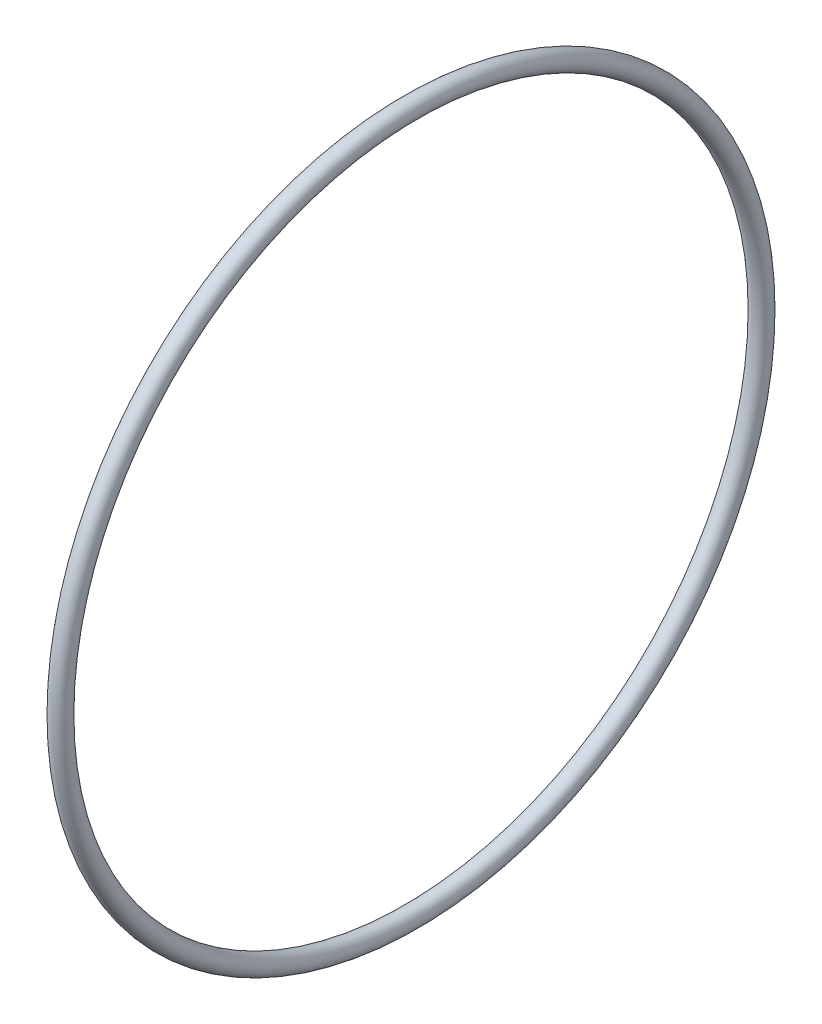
from build123d import *

# Parameters (mm, degrees)
SKETCH1_R = 1.7653


with BuildPart() as part:
    # Sketch1 → Base-Revolve (revolve)
    with BuildSketch(Plane.XY, mode=Mode.PRIVATE) as base_revolve_sk:
        with Locations((0, 65.0621)):
            Circle(SKETCH1_R)
    revolve(base_revolve_sk.sketch.rotate(Axis((0, 0, 0), (1, 0, 0)), 90), axis=Axis((0, 0, 0), (1, 0, 0)))


solid = part.part
